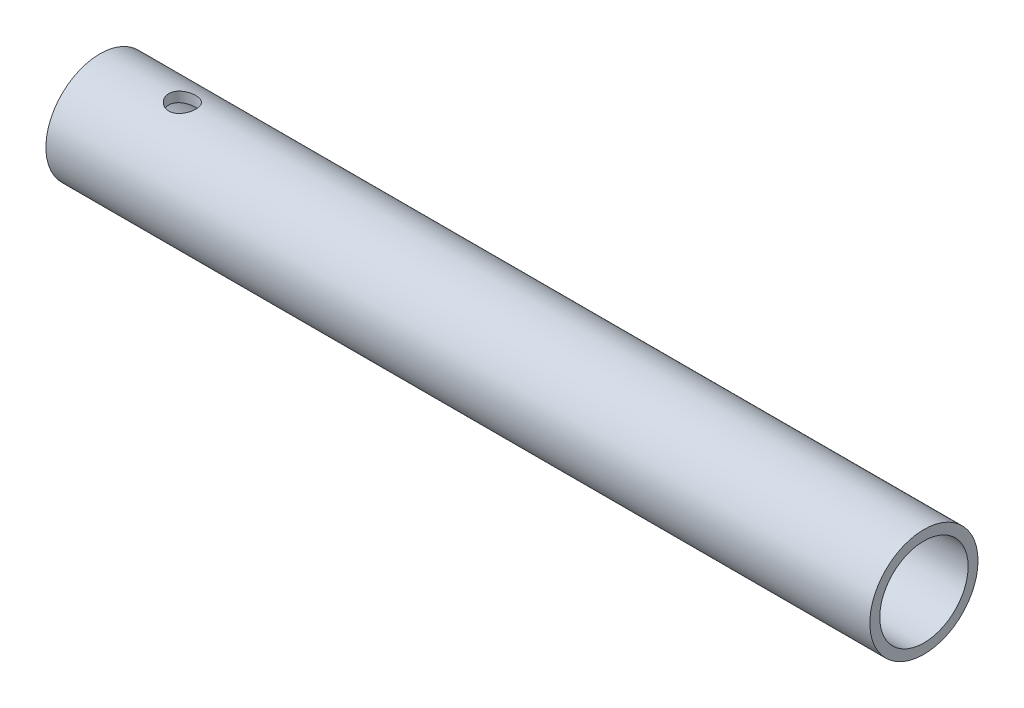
ISO-10303-21;
HEADER;
FILE_DESCRIPTION(('STEP AP214'),'2;1');
FILE_NAME('part.step','',(''),(''),'','','');
FILE_SCHEMA(('AUTOMOTIVE_DESIGN { 1 0 10303 214 1 1 1 1 }'));
ENDSEC;
DATA;
#1=APPLICATION_CONTEXT('core data for automotive mechanical design processes');
#2=APPLICATION_PROTOCOL_DEFINITION('international standard','automotive_design',2000,#1);
#3=PRODUCT_CONTEXT('',#1,'mechanical');
#4=PRODUCT('Part','Part','',(#3));
#5=PRODUCT_RELATED_PRODUCT_CATEGORY('part','',(#4));
#6=PRODUCT_DEFINITION_FORMATION('','',#4);
#7=PRODUCT_DEFINITION_CONTEXT('part definition',#1,'design');
#8=PRODUCT_DEFINITION('design','',#6,#7);
#9=PRODUCT_DEFINITION_SHAPE('','',#8);
#10=(LENGTH_UNIT() NAMED_UNIT(*) SI_UNIT(.MILLI.,.METRE.));
#11=(NAMED_UNIT(*) PLANE_ANGLE_UNIT() SI_UNIT($,.RADIAN.));
#12=(NAMED_UNIT(*) SI_UNIT($,.STERADIAN.) SOLID_ANGLE_UNIT());
#13=UNCERTAINTY_MEASURE_WITH_UNIT(LENGTH_MEASURE(1.E-05),#10,'distance_accuracy_value','');
#14=(GEOMETRIC_REPRESENTATION_CONTEXT(3) GLOBAL_UNCERTAINTY_ASSIGNED_CONTEXT((#13)) GLOBAL_UNIT_ASSIGNED_CONTEXT((#10,
#11,#12)) REPRESENTATION_CONTEXT('',''));
#15=CARTESIAN_POINT('',(0.,0.,0.));
#16=DIRECTION('',(0.,0.,1.));
#17=DIRECTION('',(1.,0.,0.));
#18=AXIS2_PLACEMENT_3D('',#15,#16,#17);
#19=CARTESIAN_POINT('',(127.,0.,0.));
#20=DIRECTION('',(1.,0.,0.));
#21=DIRECTION('',(0.,0.,-1.));
#22=AXIS2_PLACEMENT_3D('',#19,#20,#21);
#23=PLANE('',#22);
#24=CARTESIAN_POINT('',(127.,0.,0.));
#25=DIRECTION('',(1.,0.,0.));
#26=DIRECTION('',(0.,0.,-1.));
#27=AXIS2_PLACEMENT_3D('',#24,#25,#26);
#28=CIRCLE('',#27,16.66875);
#29=CARTESIAN_POINT('',(127.,0.,-16.66875));
#30=VERTEX_POINT('',#29);
#31=EDGE_CURVE('E10',#30,#30,#28,.T.);
#32=ORIENTED_EDGE('',*,*,#31,.T.);
#33=EDGE_LOOP('',(#32));
#34=FACE_BOUND('',#33,.T.);
#35=CARTESIAN_POINT('',(127.,0.,0.));
#36=DIRECTION('',(1.,0.,0.));
#37=DIRECTION('',(0.,0.,-1.));
#38=AXIS2_PLACEMENT_3D('',#35,#36,#37);
#39=CIRCLE('',#38,13.62075);
#40=CARTESIAN_POINT('',(127.,0.,-13.62075));
#41=VERTEX_POINT('',#40);
#42=EDGE_CURVE('E46',#41,#41,#39,.T.);
#43=ORIENTED_EDGE('',*,*,#42,.F.);
#44=EDGE_LOOP('',(#43));
#45=FACE_BOUND('',#44,.T.);
#46=ADVANCED_FACE('F28',(#34,#45),#23,.T.);
#47=CARTESIAN_POINT('',(-127.,0.,0.));
#48=DIRECTION('',(1.,0.,0.));
#49=DIRECTION('',(0.,0.,-1.));
#50=AXIS2_PLACEMENT_3D('',#47,#48,#49);
#51=PLANE('',#50);
#52=CARTESIAN_POINT('',(-127.,0.,0.));
#53=DIRECTION('',(1.,0.,0.));
#54=DIRECTION('',(0.,0.,-1.));
#55=AXIS2_PLACEMENT_3D('',#52,#53,#54);
#56=CIRCLE('',#55,16.66875);
#57=CARTESIAN_POINT('',(-127.,0.,-16.66875));
#58=VERTEX_POINT('',#57);
#59=EDGE_CURVE('E41',#58,#58,#56,.T.);
#60=ORIENTED_EDGE('',*,*,#59,.F.);
#61=EDGE_LOOP('',(#60));
#62=FACE_BOUND('',#61,.T.);
#63=CARTESIAN_POINT('',(-127.,0.,0.));
#64=DIRECTION('',(1.,0.,0.));
#65=DIRECTION('',(0.,0.,-1.));
#66=AXIS2_PLACEMENT_3D('',#63,#64,#65);
#67=CIRCLE('',#66,13.62075);
#68=CARTESIAN_POINT('',(-127.,0.,-13.62075));
#69=VERTEX_POINT('',#68);
#70=EDGE_CURVE('E49',#69,#69,#67,.T.);
#71=ORIENTED_EDGE('',*,*,#70,.T.);
#72=EDGE_LOOP('',(#71));
#73=FACE_BOUND('',#72,.T.);
#74=ADVANCED_FACE('F82',(#62,#73),#51,.F.);
#75=CARTESIAN_POINT('',(127.,0.,0.));
#76=DIRECTION('',(-1.,0.,0.));
#77=DIRECTION('',(0.,0.,1.));
#78=AXIS2_PLACEMENT_3D('',#75,#76,#77);
#79=CYLINDRICAL_SURFACE('',#78,16.66875);
#80=CARTESIAN_POINT('',(-105.7656,-16.66875,0.));
#81=CARTESIAN_POINT('',(-105.76559353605,-16.6687461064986,0.230155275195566));
#82=CARTESIAN_POINT('',(-105.746461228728,-16.6639356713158,0.460382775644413));
#83=CARTESIAN_POINT('',(-105.670552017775,-16.6452120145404,0.91423964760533));
#84=CARTESIAN_POINT('',(-105.613753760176,-16.6312936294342,1.13786520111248));
#85=CARTESIAN_POINT('',(-105.46444870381,-16.5958953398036,1.57189852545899));
#86=CARTESIAN_POINT('',(-105.371984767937,-16.5744245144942,1.78232181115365));
#87=CARTESIAN_POINT('',(-105.154123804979,-16.5262081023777,2.18467032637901));
#88=CARTESIAN_POINT('',(-105.028725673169,-16.4994623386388,2.37659493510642));
#89=CARTESIAN_POINT('',(-104.745829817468,-16.4429842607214,2.74044827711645));
#90=CARTESIAN_POINT('',(-104.587781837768,-16.4132058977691,2.91194206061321));
#91=CARTESIAN_POINT('',(-104.245250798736,-16.3543248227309,3.22628543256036));
#92=CARTESIAN_POINT('',(-104.060764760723,-16.3252221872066,3.36913178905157));
#93=CARTESIAN_POINT('',(-103.667217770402,-16.2705234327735,3.62417065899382));
#94=CARTESIAN_POINT('',(-103.457832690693,-16.2449857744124,3.73587669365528));
#95=CARTESIAN_POINT('',(-103.022514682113,-16.200979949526,3.92233553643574));
#96=CARTESIAN_POINT('',(-102.796584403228,-16.1825106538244,3.99709424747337));
#97=CARTESIAN_POINT('',(-102.339371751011,-16.1552059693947,4.10605266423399));
#98=CARTESIAN_POINT('',(-102.108287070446,-16.1461851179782,4.14103437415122));
#99=CARTESIAN_POINT('',(-101.643366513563,-16.1382435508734,4.17188158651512));
#100=CARTESIAN_POINT('',(-101.409531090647,-16.1393211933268,4.16775344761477));
#101=CARTESIAN_POINT('',(-100.951739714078,-16.1512881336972,4.1211220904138));
#102=CARTESIAN_POINT('',(-100.7276816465,-16.1619391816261,4.079550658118));
#103=CARTESIAN_POINT('',(-100.289825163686,-16.1914731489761,3.96069914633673));
#104=CARTESIAN_POINT('',(-100.076027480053,-16.2103566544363,3.88341652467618));
#105=CARTESIAN_POINT('',(-99.6622617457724,-16.2544465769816,3.69454212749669));
#106=CARTESIAN_POINT('',(-99.4624549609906,-16.2797148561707,3.58261211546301));
#107=CARTESIAN_POINT('',(-99.0841255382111,-16.333692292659,3.32785678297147));
#108=CARTESIAN_POINT('',(-98.9056066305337,-16.3624020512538,3.18502606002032));
#109=CARTESIAN_POINT('',(-98.569580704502,-16.4210307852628,2.86769687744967));
#110=CARTESIAN_POINT('',(-98.4128172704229,-16.4509609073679,2.69241209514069));
#111=CARTESIAN_POINT('',(-98.1307692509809,-16.5079203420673,2.31768301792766));
#112=CARTESIAN_POINT('',(-98.0054856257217,-16.5349495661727,2.11823798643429));
#113=CARTESIAN_POINT('',(-97.7896807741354,-16.5831961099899,1.69978942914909));
#114=CARTESIAN_POINT('',(-97.6992802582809,-16.6043931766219,1.48072116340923));
#115=CARTESIAN_POINT('',(-97.5567957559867,-16.6384397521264,1.0298495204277));
#116=CARTESIAN_POINT('',(-97.5047044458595,-16.6512908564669,0.798048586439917));
#117=CARTESIAN_POINT('',(-97.4414524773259,-16.6669614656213,0.334649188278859));
#118=CARTESIAN_POINT('',(-97.4292791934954,-16.6700290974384,0.103197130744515));
#119=CARTESIAN_POINT('',(-97.4434315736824,-16.6664937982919,-0.358437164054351));
#120=CARTESIAN_POINT('',(-97.4697537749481,-16.6598917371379,-0.588619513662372));
#121=CARTESIAN_POINT('',(-97.5593152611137,-16.6379178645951,-1.03766207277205));
#122=CARTESIAN_POINT('',(-97.6220021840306,-16.6226773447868,-1.25663945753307));
#123=CARTESIAN_POINT('',(-97.7818827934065,-16.585144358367,-1.68095888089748));
#124=CARTESIAN_POINT('',(-97.8790799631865,-16.5628511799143,-1.88629954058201));
#125=CARTESIAN_POINT('',(-98.1071849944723,-16.5130914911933,-2.2815459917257));
#126=CARTESIAN_POINT('',(-98.2386601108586,-16.4855402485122,-2.47111348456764));
#127=CARTESIAN_POINT('',(-98.5308637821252,-16.4284542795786,-2.82585456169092));
#128=CARTESIAN_POINT('',(-98.6915973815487,-16.3989192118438,-2.99102393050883));
#129=CARTESIAN_POINT('',(-99.0424567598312,-16.3403013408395,-3.29645254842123));
#130=CARTESIAN_POINT('',(-99.2332067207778,-16.3112473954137,-3.43600150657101));
#131=CARTESIAN_POINT('',(-99.6360145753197,-16.2576896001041,-3.68110810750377));
#132=CARTESIAN_POINT('',(-99.8480715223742,-16.2331855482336,-3.78666725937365));
#133=CARTESIAN_POINT('',(-100.286336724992,-16.1917718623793,-3.96001221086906));
#134=CARTESIAN_POINT('',(-100.51245200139,-16.1748173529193,-4.02802180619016));
#135=CARTESIAN_POINT('',(-100.973395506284,-16.1503791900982,-4.12492702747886));
#136=CARTESIAN_POINT('',(-101.208221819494,-16.1428934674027,-4.15383119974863));
#137=CARTESIAN_POINT('',(-101.672693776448,-16.1383980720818,-4.17125880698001));
#138=CARTESIAN_POINT('',(-101.902294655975,-16.1410938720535,-4.16091747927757));
#139=CARTESIAN_POINT('',(-102.356367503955,-16.1559768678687,-4.10274562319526));
#140=CARTESIAN_POINT('',(-102.580839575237,-16.1681638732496,-4.05491584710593));
#141=CARTESIAN_POINT('',(-103.017049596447,-16.2004920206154,-3.92374460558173));
#142=CARTESIAN_POINT('',(-103.228855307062,-16.2205854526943,-3.84061591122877));
#143=CARTESIAN_POINT('',(-103.635664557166,-16.2664691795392,-3.64137497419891));
#144=CARTESIAN_POINT('',(-103.830665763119,-16.2922602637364,-3.52525816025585));
#145=CARTESIAN_POINT('',(-104.203816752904,-16.3474733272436,-3.25977735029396));
#146=CARTESIAN_POINT('',(-104.381394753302,-16.3769724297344,-3.10962558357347));
#147=CARTESIAN_POINT('',(-104.70920318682,-16.4358171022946,-2.78187247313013));
#148=CARTESIAN_POINT('',(-104.85942711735,-16.4651626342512,-2.60426462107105));
#149=CARTESIAN_POINT('',(-105.130913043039,-16.5210272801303,-2.22276256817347));
#150=CARTESIAN_POINT('',(-105.251601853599,-16.5474856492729,-2.01845090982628));
#151=CARTESIAN_POINT('',(-105.456727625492,-16.5939540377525,-1.59179589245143));
#152=CARTESIAN_POINT('',(-105.541190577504,-16.6139686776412,-1.36946559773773));
#153=CARTESIAN_POINT('',(-105.658921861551,-16.6423337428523,-0.956275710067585));
#154=CARTESIAN_POINT('',(-105.698839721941,-16.6521718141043,-0.767385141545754));
#155=CARTESIAN_POINT('',(-105.752180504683,-16.665381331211,-0.385679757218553));
#156=CARTESIAN_POINT('',(-105.765605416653,-16.6687532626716,-0.192865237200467));
#157=CARTESIAN_POINT('',(-105.7656,-16.66875,0.));
#158=B_SPLINE_CURVE_WITH_KNOTS('',3,(#80,#81,#82,#83,#84,#85,#86,#87,#88,#89,#90,#91,#92,#93,
#94,#95,#96,#97,#98,#99,#100,#101,#102,#103,#104,#105,#106,#107,#108,#109,#110,#111,#112,#113,
#114,#115,#116,#117,#118,#119,#120,#121,#122,#123,#124,#125,#126,#127,#128,#129,#130,#131,#132,
#133,#134,#135,#136,#137,#138,#139,#140,#141,#142,#143,#144,#145,#146,#147,#148,#149,#150,#151,
#152,#153,#154,#155,#156,#157),.UNSPECIFIED.,.T.,.F.,(4,2,2,2,2,2,2,2,2,2,2,2,2,2,2,2,2,2,2,2,2,
2,2,2,2,2,2,2,2,2,2,2,2,2,2,2,2,2,4),(0.,0.689759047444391,1.37990947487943,2.06923305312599,
2.75857975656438,3.4606625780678,4.1628245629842,4.87540899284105,5.58787953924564,
6.28608687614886,6.98418069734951,7.66536813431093,8.34660407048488,9.03471212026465,
9.72294057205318,10.4307778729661,11.1386367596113,11.8489236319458,12.5590746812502,
13.2510655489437,13.9429941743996,14.6246781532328,15.3064309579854,16.0002739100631,
16.6942366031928,17.405219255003,18.1161703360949,18.8228370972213,19.5293493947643,
20.2155826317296,20.9018020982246,21.5839426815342,22.2661778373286,22.9661972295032,
23.6663828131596,24.3792368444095,25.0915785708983,25.6696254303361,26.2476288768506),.UNSPECIFIED.);
#159=CARTESIAN_POINT('',(-105.7656,-16.66875,0.));
#160=VERTEX_POINT('',#159);
#161=EDGE_CURVE('E72',#160,#160,#158,.T.);
#162=ORIENTED_EDGE('',*,*,#161,.T.);
#163=EDGE_LOOP('',(#162));
#164=FACE_BOUND('',#163,.T.);
#165=CARTESIAN_POINT('',(-101.6,16.1398575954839,4.1656));
#166=CARTESIAN_POINT('',(-101.830028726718,16.1398619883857,4.16559346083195));
#167=CARTESIAN_POINT('',(-102.060129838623,16.1448289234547,4.14648146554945));
#168=CARTESIAN_POINT('',(-102.513724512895,16.1641092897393,4.07066023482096));
#169=CARTESIAN_POINT('',(-102.737214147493,16.1784281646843,4.01392910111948));
#170=CARTESIAN_POINT('',(-103.170959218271,16.2146917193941,3.86482019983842));
#171=CARTESIAN_POINT('',(-103.381231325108,16.2366265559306,3.77248842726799));
#172=CARTESIAN_POINT('',(-103.783323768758,16.2856382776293,3.55493924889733));
#173=CARTESIAN_POINT('',(-103.97514332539,16.3127153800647,3.42972045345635));
#174=CARTESIAN_POINT('',(-104.339103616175,16.3696272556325,3.14701064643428));
#175=CARTESIAN_POINT('',(-104.51077877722,16.3995060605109,2.98892900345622));
#176=CARTESIAN_POINT('',(-104.825475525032,16.4582727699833,2.64625303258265));
#177=CARTESIAN_POINT('',(-104.968494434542,16.4871605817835,2.46165623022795));
#178=CARTESIAN_POINT('',(-105.223723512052,16.5411775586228,2.06800068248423));
#179=CARTESIAN_POINT('',(-105.335476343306,16.5662487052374,1.85863676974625));
#180=CARTESIAN_POINT('',(-105.522027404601,16.6093051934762,1.42336411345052));
#181=CARTESIAN_POINT('',(-105.596831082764,16.6272915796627,1.19745781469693));
#182=CARTESIAN_POINT('',(-105.705869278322,16.6538406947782,0.740366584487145));
#183=CARTESIAN_POINT('',(-105.740894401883,16.6625868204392,0.509381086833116));
#184=CARTESIAN_POINT('',(-105.771862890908,16.6703090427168,0.0446582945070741));
#185=CARTESIAN_POINT('',(-105.767812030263,16.669286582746,-0.189078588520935));
#186=CARTESIAN_POINT('',(-105.721312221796,16.6577233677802,-0.647186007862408));
#187=CARTESIAN_POINT('',(-105.679716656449,16.6473941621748,-0.871649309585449));
#188=CARTESIAN_POINT('',(-105.560679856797,16.6186243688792,-1.31030333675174));
#189=CARTESIAN_POINT('',(-105.483236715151,16.6001833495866,-1.52449351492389));
#190=CARTESIAN_POINT('',(-105.294012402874,16.5569383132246,-1.93876991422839));
#191=CARTESIAN_POINT('',(-105.181927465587,16.5320783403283,-2.13871130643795));
#192=CARTESIAN_POINT('',(-104.926831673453,16.4786921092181,-2.51724623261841));
#193=CARTESIAN_POINT('',(-104.78381544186,16.4501652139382,-2.6958360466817));
#194=CARTESIAN_POINT('',(-104.466341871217,16.3916435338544,-3.0316876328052));
#195=CARTESIAN_POINT('',(-104.291138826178,16.3616299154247,-3.1882419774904));
#196=CARTESIAN_POINT('',(-103.916651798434,16.3042235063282,-3.46990539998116));
#197=CARTESIAN_POINT('',(-103.717366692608,16.276830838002,-3.59501301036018));
#198=CARTESIAN_POINT('',(-103.298985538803,16.2277004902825,-3.81068413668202));
#199=CARTESIAN_POINT('',(-103.079798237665,16.2059908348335,-3.90107745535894));
#200=CARTESIAN_POINT('',(-102.628664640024,16.1710442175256,-4.04351236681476));
#201=CARTESIAN_POINT('',(-102.396721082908,16.1578054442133,-4.09556215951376));
#202=CARTESIAN_POINT('',(-101.933219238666,16.1416796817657,-4.15865901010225));
#203=CARTESIAN_POINT('',(-101.701812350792,16.1385287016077,-4.1707519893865));
#204=CARTESIAN_POINT('',(-101.240286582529,16.1422167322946,-4.15645525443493));
#205=CARTESIAN_POINT('',(-101.010167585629,16.1490548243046,-4.13006907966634));
#206=CARTESIAN_POINT('',(-100.561632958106,16.1716975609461,-4.04048008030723));
#207=CARTESIAN_POINT('',(-100.343087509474,16.1873538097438,-3.97788611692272));
#208=CARTESIAN_POINT('',(-99.9195914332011,16.2257279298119,-3.8183333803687));
#209=CARTESIAN_POINT('',(-99.7146424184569,16.2484466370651,-3.72137053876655));
#210=CARTESIAN_POINT('',(-99.3197250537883,16.2989417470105,-3.49364288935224));
#211=CARTESIAN_POINT('',(-99.130129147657,16.3268085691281,-3.36225269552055));
#212=CARTESIAN_POINT('',(-98.775292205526,16.3842381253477,-3.07019088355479));
#213=CARTESIAN_POINT('',(-98.6100551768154,16.413801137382,-2.90951445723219));
#214=CARTESIAN_POINT('',(-98.3043901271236,16.4721866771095,-2.55864134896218));
#215=CARTESIAN_POINT('',(-98.1646856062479,16.5009722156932,-2.36780708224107));
#216=CARTESIAN_POINT('',(-97.9193056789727,16.5537943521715,-1.96478029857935));
#217=CARTESIAN_POINT('',(-97.8136284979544,16.5778311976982,-1.75258889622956));
#218=CARTESIAN_POINT('',(-97.6402201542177,16.6182961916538,-1.31433723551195));
#219=CARTESIAN_POINT('',(-97.5722161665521,16.6347788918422,-1.08839020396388));
#220=CARTESIAN_POINT('',(-97.4752655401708,16.6585172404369,-0.627808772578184));
#221=CARTESIAN_POINT('',(-97.4463113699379,16.665774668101,-0.393176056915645));
#222=CARTESIAN_POINT('',(-97.428705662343,16.6701721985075,0.0713191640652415));
#223=CARTESIAN_POINT('',(-97.4389863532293,16.6675803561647,0.301139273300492));
#224=CARTESIAN_POINT('',(-97.4971130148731,16.6531649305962,0.755667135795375));
#225=CARTESIAN_POINT('',(-97.544957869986,16.6413416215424,0.980375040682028));
#226=CARTESIAN_POINT('',(-97.6762822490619,16.6098331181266,1.41718320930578));
#227=CARTESIAN_POINT('',(-97.7595688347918,16.5901905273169,1.62934475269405));
#228=CARTESIAN_POINT('',(-97.9592373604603,16.5451119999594,2.03680209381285));
#229=CARTESIAN_POINT('',(-98.0756234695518,16.5196753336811,2.23209576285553));
#230=CARTESIAN_POINT('',(-98.3414444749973,16.4649903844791,2.60533698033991));
#231=CARTESIAN_POINT('',(-98.4916039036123,16.435665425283,2.78275728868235));
#232=CARTESIAN_POINT('',(-98.819302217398,16.3768541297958,3.11024421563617));
#233=CARTESIAN_POINT('',(-98.9968480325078,16.3473677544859,3.26030388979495));
#234=CARTESIAN_POINT('',(-99.3782624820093,16.290946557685,3.53155546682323));
#235=CARTESIAN_POINT('',(-99.5825600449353,16.2640695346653,3.65215720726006));
#236=CARTESIAN_POINT('',(-100.00917271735,16.2166879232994,3.85712378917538));
#237=CARTESIAN_POINT('',(-100.231474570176,16.1961786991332,3.94151500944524));
#238=CARTESIAN_POINT('',(-100.644489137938,16.1670619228,4.05909368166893));
#239=CARTESIAN_POINT('',(-100.833224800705,16.1569370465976,4.09894651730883));
#240=CARTESIAN_POINT('',(-101.214623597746,16.1433333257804,4.15220128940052));
#241=CARTESIAN_POINT('',(-101.407286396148,16.1398539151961,4.16560547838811));
#242=CARTESIAN_POINT('',(-101.6,16.1398575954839,4.1656));
#243=B_SPLINE_CURVE_WITH_KNOTS('',3,(#165,#166,#167,#168,#169,#170,#171,#172,#173,#174,#175,
#176,#177,#178,#179,#180,#181,#182,#183,#184,#185,#186,#187,#188,#189,#190,#191,#192,#193,#194,
#195,#196,#197,#198,#199,#200,#201,#202,#203,#204,#205,#206,#207,#208,#209,#210,#211,#212,#213,
#214,#215,#216,#217,#218,#219,#220,#221,#222,#223,#224,#225,#226,#227,#228,#229,#230,#231,#232,
#233,#234,#235,#236,#237,#238,#239,#240,#241,#242),.UNSPECIFIED.,.T.,.F.,(4,2,2,2,2,2,2,2,2,2,2,
2,2,2,2,2,2,2,2,2,2,2,2,2,2,2,2,2,2,2,2,2,2,2,2,2,2,2,4),(0.,0.689378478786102,1.37915860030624,
2.06805051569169,2.75697154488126,3.45955168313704,4.16219743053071,4.87463949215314,
5.58697647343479,6.28489328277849,6.98270696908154,7.6650482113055,8.34742576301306,
9.03596537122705,9.72462476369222,10.4319085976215,11.139225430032,11.8499671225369,
12.5605567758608,13.2523919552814,13.9441635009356,14.6246272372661,15.3051715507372,
15.9990571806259,16.6930568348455,17.4044065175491,18.1157190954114,18.8218107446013,
19.527766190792,20.2146479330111,20.9015092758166,21.584678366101,22.2679335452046,
22.9675470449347,23.6673378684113,24.3801713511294,25.0924846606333,25.6700817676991,
26.2476296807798),.UNSPECIFIED.);
#244=CARTESIAN_POINT('',(-101.6,16.1398575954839,4.1656));
#245=VERTEX_POINT('',#244);
#246=EDGE_CURVE('E68',#245,#245,#243,.T.);
#247=ORIENTED_EDGE('',*,*,#246,.T.);
#248=EDGE_LOOP('',(#247));
#249=FACE_BOUND('',#248,.T.);
#250=ORIENTED_EDGE('',*,*,#31,.F.);
#251=EDGE_LOOP('',(#250));
#252=FACE_BOUND('',#251,.T.);
#253=ORIENTED_EDGE('',*,*,#59,.T.);
#254=EDGE_LOOP('',(#253));
#255=FACE_BOUND('',#254,.T.);
#256=ADVANCED_FACE('F30',(#164,#249,#252,#255),#79,.T.);
#257=CARTESIAN_POINT('',(127.,0.,0.));
#258=DIRECTION('',(-1.,0.,0.));
#259=DIRECTION('',(0.,0.,1.));
#260=AXIS2_PLACEMENT_3D('',#257,#258,#259);
#261=CYLINDRICAL_SURFACE('',#260,13.62075);
#262=CARTESIAN_POINT('',(-101.6,-12.9681381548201,4.1656));
#263=CARTESIAN_POINT('',(-101.371968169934,-12.968140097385,4.16559774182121));
#264=CARTESIAN_POINT('',(-101.143913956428,-12.9742185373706,4.14681211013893));
#265=CARTESIAN_POINT('',(-100.694487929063,-12.9977736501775,4.07236935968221));
#266=CARTESIAN_POINT('',(-100.473118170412,-13.0152537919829,4.0167010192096));
#267=CARTESIAN_POINT('',(-100.043633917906,-13.0594513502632,3.87057190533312));
#268=CARTESIAN_POINT('',(-99.835497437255,-13.0861529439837,3.78017069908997));
#269=CARTESIAN_POINT('',(-99.4372908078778,-13.1457631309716,3.56733917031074));
#270=CARTESIAN_POINT('',(-99.2472235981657,-13.1786727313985,3.44490364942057));
#271=CARTESIAN_POINT('',(-98.8842987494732,-13.2482049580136,3.16716656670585));
#272=CARTESIAN_POINT('',(-98.7121231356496,-13.2849090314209,3.01099397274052));
#273=CARTESIAN_POINT('',(-98.3959519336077,-13.3572000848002,2.67208125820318));
#274=CARTESIAN_POINT('',(-98.2519601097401,-13.3927869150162,2.48933759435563));
#275=CARTESIAN_POINT('',(-97.9932601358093,-13.4597619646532,2.09759560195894));
#276=CARTESIAN_POINT('',(-97.879250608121,-13.491043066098,1.88811599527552));
#277=CARTESIAN_POINT('',(-97.6883443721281,-13.5449336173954,1.45183715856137));
#278=CARTESIAN_POINT('',(-97.6114393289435,-13.5675450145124,1.22504183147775));
#279=CARTESIAN_POINT('',(-97.4991914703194,-13.6009720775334,0.767707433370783));
#280=CARTESIAN_POINT('',(-97.4626837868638,-13.612117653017,0.537478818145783));
#281=CARTESIAN_POINT('',(-97.4285801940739,-13.6225206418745,0.0739123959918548));
#282=CARTESIAN_POINT('',(-97.4309758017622,-13.6217806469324,-0.159424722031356));
#283=CARTESIAN_POINT('',(-97.4738360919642,-13.6087274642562,-0.614400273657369));
#284=CARTESIAN_POINT('',(-97.5130387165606,-13.596797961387,-0.836170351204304));
#285=CARTESIAN_POINT('',(-97.6263343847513,-13.5631750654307,-1.26981812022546));
#286=CARTESIAN_POINT('',(-97.7004296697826,-13.541481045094,-1.48169517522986));
#287=CARTESIAN_POINT('',(-97.8822416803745,-13.4902433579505,-1.89250177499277));
#288=CARTESIAN_POINT('',(-97.990348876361,-13.4606091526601,-2.09124675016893));
#289=CARTESIAN_POINT('',(-98.2368050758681,-13.3966247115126,-2.46817332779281));
#290=CARTESIAN_POINT('',(-98.3751614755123,-13.3622733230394,-2.64634988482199));
#291=CARTESIAN_POINT('',(-98.68470380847,-13.290900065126,-2.9846108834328));
#292=CARTESIAN_POINT('',(-98.8569814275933,-13.253826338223,-3.14368674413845));
#293=CARTESIAN_POINT('',(-99.226122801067,-13.1823808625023,-3.43098215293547));
#294=CARTESIAN_POINT('',(-99.4229891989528,-13.1480094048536,-3.55919837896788));
#295=CARTESIAN_POINT('',(-99.8384647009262,-13.0856058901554,-3.78224244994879));
#296=CARTESIAN_POINT('',(-100.057277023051,-13.0576428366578,-3.87671247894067));
#297=CARTESIAN_POINT('',(-100.508762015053,-13.0120364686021,-4.02715639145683));
#298=CARTESIAN_POINT('',(-100.741429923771,-12.9943896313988,-4.08314341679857));
#299=CARTESIAN_POINT('',(-101.204392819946,-12.9721909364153,-4.15311891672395));
#300=CARTESIAN_POINT('',(-101.434432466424,-12.9671597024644,-4.1686457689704));
#301=CARTESIAN_POINT('',(-101.893841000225,-12.969433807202,-4.1615666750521));
#302=CARTESIAN_POINT('',(-102.123209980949,-12.9767373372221,-4.1389663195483));
#303=CARTESIAN_POINT('',(-102.56825479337,-13.0023862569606,-4.05764663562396));
#304=CARTESIAN_POINT('',(-102.784133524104,-13.0204245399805,-3.99993091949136));
#305=CARTESIAN_POINT('',(-103.203124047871,-13.065188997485,-3.85118929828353));
#306=CARTESIAN_POINT('',(-103.406233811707,-13.0919165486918,-3.76015811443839));
#307=CARTESIAN_POINT('',(-103.800143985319,-13.1519677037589,-3.5444889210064));
#308=CARTESIAN_POINT('',(-103.990447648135,-13.1854534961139,-3.41898992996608));
#309=CARTESIAN_POINT('',(-104.347855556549,-13.2549055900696,-3.13896200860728));
#310=CARTESIAN_POINT('',(-104.514954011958,-13.2908725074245,-2.98442585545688));
#311=CARTESIAN_POINT('',(-104.828002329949,-13.3629509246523,-2.64345647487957));
#312=CARTESIAN_POINT('',(-104.972858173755,-13.3990121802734,-2.45600561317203));
#313=CARTESIAN_POINT('',(-105.229092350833,-13.4657926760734,-2.05859096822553));
#314=CARTESIAN_POINT('',(-105.340472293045,-13.4965121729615,-1.84862826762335));
#315=CARTESIAN_POINT('',(-105.525519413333,-13.5489654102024,-1.41349804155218));
#316=CARTESIAN_POINT('',(-105.599464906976,-13.5707652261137,-1.18845724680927));
#317=CARTESIAN_POINT('',(-105.708230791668,-13.6032142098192,-0.728353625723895));
#318=CARTESIAN_POINT('',(-105.74306285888,-13.6138667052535,-0.49329381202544));
#319=CARTESIAN_POINT('',(-105.771697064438,-13.6226099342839,-0.0299164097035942));
#320=CARTESIAN_POINT('',(-105.76708279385,-13.6211855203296,0.198295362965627));
#321=CARTESIAN_POINT('',(-105.720761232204,-13.6070863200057,0.650547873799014));
#322=CARTESIAN_POINT('',(-105.679056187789,-13.5944122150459,0.874588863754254));
#323=CARTESIAN_POINT('',(-105.560730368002,-13.5593830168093,1.30961166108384));
#324=CARTESIAN_POINT('',(-105.484518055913,-13.5371413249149,1.52071433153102));
#325=CARTESIAN_POINT('',(-105.299707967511,-13.4852736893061,1.92724290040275));
#326=CARTESIAN_POINT('',(-105.191104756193,-13.4556465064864,2.12266616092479));
#327=CARTESIAN_POINT('',(-104.940457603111,-13.3908983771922,2.49928044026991));
#328=CARTESIAN_POINT('',(-104.797430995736,-13.3556287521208,2.6797916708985));
#329=CARTESIAN_POINT('',(-104.483749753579,-13.2840256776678,3.01477891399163));
#330=CARTESIAN_POINT('',(-104.313087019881,-13.2476919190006,3.16924726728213));
#331=CARTESIAN_POINT('',(-103.942565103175,-13.1767289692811,3.45263509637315));
#332=CARTESIAN_POINT('',(-103.741958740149,-13.1421888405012,3.58060255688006));
#333=CARTESIAN_POINT('',(-103.321064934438,-13.0801943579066,3.80085675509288));
#334=CARTESIAN_POINT('',(-103.100786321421,-13.0527368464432,3.89315940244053));
#335=CARTESIAN_POINT('',(-102.668902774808,-13.0105179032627,4.03187229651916));
#336=CARTESIAN_POINT('',(-102.458544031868,-12.9947800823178,4.08187785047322));
#337=CARTESIAN_POINT('',(-102.032129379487,-12.9735904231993,4.14873911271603));
#338=CARTESIAN_POINT('',(-101.816074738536,-12.9681363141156,4.16560213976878));
#339=CARTESIAN_POINT('',(-101.6,-12.9681381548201,4.1656));
#340=B_SPLINE_CURVE_WITH_KNOTS('',3,(#262,#263,#264,#265,#266,#267,#268,#269,#270,#271,#272,
#273,#274,#275,#276,#277,#278,#279,#280,#281,#282,#283,#284,#285,#286,#287,#288,#289,#290,#291,
#292,#293,#294,#295,#296,#297,#298,#299,#300,#301,#302,#303,#304,#305,#306,#307,#308,#309,#310,
#311,#312,#313,#314,#315,#316,#317,#318,#319,#320,#321,#322,#323,#324,#325,#326,#327,#328,#329,
#330,#331,#332,#333,#334,#335,#336,#337,#338,#339),.UNSPECIFIED.,.T.,.F.,(4,2,2,2,2,2,2,2,2,2,2,
2,2,2,2,2,2,2,2,2,2,2,2,2,2,2,2,2,2,2,2,2,2,2,2,2,2,2,4),(0.,0.683297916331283,1.36680382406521,
2.04914270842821,2.73159238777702,3.43438845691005,4.13727833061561,4.85532912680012,
5.57321855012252,6.26981950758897,6.96626857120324,7.63967706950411,8.31312883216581,
8.99461301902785,9.67626401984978,10.3851771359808,11.0941665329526,11.8104646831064,
12.5265180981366,13.2149194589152,13.9032198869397,14.5727164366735,15.2423191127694,
15.930467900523,16.6187880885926,17.3342555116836,18.0496885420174,18.7597213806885,
19.4695422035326,20.1510049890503,20.8324265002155,21.5059847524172,22.1796560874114,
22.875491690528,23.5715315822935,24.2893773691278,25.0069025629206,25.654514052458,
26.3019825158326),.UNSPECIFIED.);
#341=CARTESIAN_POINT('',(-101.6,-12.9681381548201,4.1656));
#342=VERTEX_POINT('',#341);
#343=EDGE_CURVE('E33',#342,#342,#340,.T.);
#344=ORIENTED_EDGE('',*,*,#343,.F.);
#345=EDGE_LOOP('',(#344));
#346=FACE_BOUND('',#345,.T.);
#347=CARTESIAN_POINT('',(-101.6,12.9681381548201,4.1656));
#348=CARTESIAN_POINT('',(-101.828031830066,12.968140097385,4.16559774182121));
#349=CARTESIAN_POINT('',(-102.056086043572,12.9742185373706,4.14681211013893));
#350=CARTESIAN_POINT('',(-102.505512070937,12.9977736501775,4.07236935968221));
#351=CARTESIAN_POINT('',(-102.726881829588,13.0152537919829,4.0167010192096));
#352=CARTESIAN_POINT('',(-103.156366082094,13.0594513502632,3.87057190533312));
#353=CARTESIAN_POINT('',(-103.364502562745,13.0861529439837,3.78017069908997));
#354=CARTESIAN_POINT('',(-103.762709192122,13.1457631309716,3.56733917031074));
#355=CARTESIAN_POINT('',(-103.952776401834,13.1786727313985,3.44490364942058));
#356=CARTESIAN_POINT('',(-104.315701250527,13.2482049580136,3.16716656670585));
#357=CARTESIAN_POINT('',(-104.48787686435,13.2849090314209,3.01099397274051));
#358=CARTESIAN_POINT('',(-104.804048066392,13.3572000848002,2.67208125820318));
#359=CARTESIAN_POINT('',(-104.94803989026,13.3927869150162,2.48933759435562));
#360=CARTESIAN_POINT('',(-105.206739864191,13.4597619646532,2.09759560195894));
#361=CARTESIAN_POINT('',(-105.320749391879,13.491043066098,1.88811599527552));
#362=CARTESIAN_POINT('',(-105.511655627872,13.5449336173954,1.45183715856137));
#363=CARTESIAN_POINT('',(-105.588560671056,13.5675450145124,1.22504183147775));
#364=CARTESIAN_POINT('',(-105.700808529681,13.6009720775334,0.767707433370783));
#365=CARTESIAN_POINT('',(-105.737316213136,13.612117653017,0.537478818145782));
#366=CARTESIAN_POINT('',(-105.771419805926,13.6225206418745,0.0739123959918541));
#367=CARTESIAN_POINT('',(-105.769024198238,13.6217806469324,-0.159424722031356));
#368=CARTESIAN_POINT('',(-105.726163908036,13.6087274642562,-0.614400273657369));
#369=CARTESIAN_POINT('',(-105.686961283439,13.596797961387,-0.836170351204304));
#370=CARTESIAN_POINT('',(-105.573665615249,13.5631750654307,-1.26981812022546));
#371=CARTESIAN_POINT('',(-105.499570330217,13.541481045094,-1.48169517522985));
#372=CARTESIAN_POINT('',(-105.317758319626,13.4902433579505,-1.89250177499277));
#373=CARTESIAN_POINT('',(-105.209651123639,13.4606091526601,-2.09124675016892));
#374=CARTESIAN_POINT('',(-104.963194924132,13.3966247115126,-2.4681733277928));
#375=CARTESIAN_POINT('',(-104.824838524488,13.3622733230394,-2.64634988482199));
#376=CARTESIAN_POINT('',(-104.51529619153,13.290900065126,-2.9846108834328));
#377=CARTESIAN_POINT('',(-104.343018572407,13.253826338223,-3.14368674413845));
#378=CARTESIAN_POINT('',(-103.973877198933,13.1823808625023,-3.43098215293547));
#379=CARTESIAN_POINT('',(-103.777010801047,13.1480094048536,-3.55919837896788));
#380=CARTESIAN_POINT('',(-103.361535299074,13.0856058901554,-3.78224244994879));
#381=CARTESIAN_POINT('',(-103.142722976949,13.0576428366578,-3.87671247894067));
#382=CARTESIAN_POINT('',(-102.691237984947,13.0120364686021,-4.02715639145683));
#383=CARTESIAN_POINT('',(-102.458570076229,12.9943896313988,-4.08314341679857));
#384=CARTESIAN_POINT('',(-101.995607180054,12.9721909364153,-4.15311891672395));
#385=CARTESIAN_POINT('',(-101.765567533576,12.9671597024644,-4.1686457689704));
#386=CARTESIAN_POINT('',(-101.306158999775,12.969433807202,-4.1615666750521));
#387=CARTESIAN_POINT('',(-101.076790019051,12.9767373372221,-4.1389663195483));
#388=CARTESIAN_POINT('',(-100.63174520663,13.0023862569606,-4.05764663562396));
#389=CARTESIAN_POINT('',(-100.415866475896,13.0204245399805,-3.99993091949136));
#390=CARTESIAN_POINT('',(-99.9968759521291,13.065188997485,-3.85118929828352));
#391=CARTESIAN_POINT('',(-99.7937661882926,13.0919165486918,-3.76015811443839));
#392=CARTESIAN_POINT('',(-99.3998560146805,13.1519677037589,-3.5444889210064));
#393=CARTESIAN_POINT('',(-99.2095523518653,13.1854534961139,-3.41898992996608));
#394=CARTESIAN_POINT('',(-98.8521444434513,13.2549055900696,-3.13896200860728));
#395=CARTESIAN_POINT('',(-98.6850459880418,13.2908725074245,-2.98442585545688));
#396=CARTESIAN_POINT('',(-98.3719976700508,13.3629509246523,-2.64345647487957));
#397=CARTESIAN_POINT('',(-98.2271418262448,13.3990121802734,-2.45600561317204));
#398=CARTESIAN_POINT('',(-97.970907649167,13.4657926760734,-2.05859096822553));
#399=CARTESIAN_POINT('',(-97.8595277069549,13.4965121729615,-1.84862826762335));
#400=CARTESIAN_POINT('',(-97.6744805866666,13.5489654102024,-1.41349804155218));
#401=CARTESIAN_POINT('',(-97.6005350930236,13.5707652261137,-1.18845724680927));
#402=CARTESIAN_POINT('',(-97.4917692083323,13.6032142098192,-0.728353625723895));
#403=CARTESIAN_POINT('',(-97.4569371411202,13.6138667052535,-0.49329381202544));
#404=CARTESIAN_POINT('',(-97.4283029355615,13.6226099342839,-0.0299164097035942));
#405=CARTESIAN_POINT('',(-97.4329172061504,13.6211855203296,0.198295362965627));
#406=CARTESIAN_POINT('',(-97.4792387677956,13.6070863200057,0.650547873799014));
#407=CARTESIAN_POINT('',(-97.5209438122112,13.5944122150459,0.874588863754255));
#408=CARTESIAN_POINT('',(-97.6392696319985,13.5593830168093,1.30961166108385));
#409=CARTESIAN_POINT('',(-97.7154819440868,13.5371413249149,1.52071433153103));
#410=CARTESIAN_POINT('',(-97.9002920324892,13.4852736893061,1.92724290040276));
#411=CARTESIAN_POINT('',(-98.0088952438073,13.4556465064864,2.1226661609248));
#412=CARTESIAN_POINT('',(-98.2595423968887,13.3908983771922,2.49928044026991));
#413=CARTESIAN_POINT('',(-98.4025690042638,13.3556287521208,2.6797916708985));
#414=CARTESIAN_POINT('',(-98.7162502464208,13.2840256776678,3.01477891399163));
#415=CARTESIAN_POINT('',(-98.8869129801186,13.2476919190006,3.16924726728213));
#416=CARTESIAN_POINT('',(-99.2574348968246,13.1767289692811,3.45263509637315));
#417=CARTESIAN_POINT('',(-99.4580412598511,13.1421888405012,3.58060255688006));
#418=CARTESIAN_POINT('',(-99.8789350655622,13.0801943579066,3.80085675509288));
#419=CARTESIAN_POINT('',(-100.099213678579,13.0527368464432,3.89315940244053));
#420=CARTESIAN_POINT('',(-100.531097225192,13.0105179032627,4.03187229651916));
#421=CARTESIAN_POINT('',(-100.741455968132,12.9947800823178,4.08187785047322));
#422=CARTESIAN_POINT('',(-101.167870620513,12.9735904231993,4.14873911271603));
#423=CARTESIAN_POINT('',(-101.383925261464,12.9681363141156,4.16560213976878));
#424=CARTESIAN_POINT('',(-101.6,12.9681381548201,4.1656));
#425=B_SPLINE_CURVE_WITH_KNOTS('',3,(#347,#348,#349,#350,#351,#352,#353,#354,#355,#356,#357,
#358,#359,#360,#361,#362,#363,#364,#365,#366,#367,#368,#369,#370,#371,#372,#373,#374,#375,#376,
#377,#378,#379,#380,#381,#382,#383,#384,#385,#386,#387,#388,#389,#390,#391,#392,#393,#394,#395,
#396,#397,#398,#399,#400,#401,#402,#403,#404,#405,#406,#407,#408,#409,#410,#411,#412,#413,#414,
#415,#416,#417,#418,#419,#420,#421,#422,#423,#424),.UNSPECIFIED.,.T.,.F.,(4,2,2,2,2,2,2,2,2,2,2,
2,2,2,2,2,2,2,2,2,2,2,2,2,2,2,2,2,2,2,2,2,2,2,2,2,2,2,4),(0.,0.683297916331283,1.36680382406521,
2.04914270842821,2.73159238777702,3.43438845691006,4.13727833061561,4.85532912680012,
5.57321855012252,6.26981950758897,6.96626857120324,7.63967706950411,8.31312883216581,
8.99461301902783,9.67626401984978,10.3851771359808,11.0941665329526,11.8104646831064,
12.5265180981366,13.2149194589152,13.9032198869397,14.5727164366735,15.2423191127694,
15.9304679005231,16.6187880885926,17.3342555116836,18.0496885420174,18.7597213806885,
19.4695422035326,20.1510049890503,20.8324265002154,21.5059847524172,22.1796560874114,
22.8754916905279,23.5715315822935,24.2893773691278,25.0069025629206,25.654514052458,
26.3019825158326),.UNSPECIFIED.);
#426=CARTESIAN_POINT('',(-101.6,12.9681381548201,4.1656));
#427=VERTEX_POINT('',#426);
#428=EDGE_CURVE('E51',#427,#427,#425,.T.);
#429=ORIENTED_EDGE('',*,*,#428,.F.);
#430=EDGE_LOOP('',(#429));
#431=FACE_BOUND('',#430,.T.);
#432=ORIENTED_EDGE('',*,*,#42,.T.);
#433=EDGE_LOOP('',(#432));
#434=FACE_BOUND('',#433,.T.);
#435=ORIENTED_EDGE('',*,*,#70,.F.);
#436=EDGE_LOOP('',(#435));
#437=FACE_BOUND('',#436,.T.);
#438=ADVANCED_FACE('F55',(#346,#431,#434,#437),#261,.F.);
#439=CARTESIAN_POINT('',(-101.6,-16.66875,0.));
#440=DIRECTION('',(0.,1.,0.));
#441=DIRECTION('',(0.,0.,1.));
#442=AXIS2_PLACEMENT_3D('',#439,#440,#441);
#443=CYLINDRICAL_SURFACE('',#442,4.1656);
#444=ORIENTED_EDGE('',*,*,#428,.T.);
#445=EDGE_LOOP('',(#444));
#446=FACE_BOUND('',#445,.T.);
#447=ORIENTED_EDGE('',*,*,#246,.F.);
#448=EDGE_LOOP('',(#447));
#449=FACE_BOUND('',#448,.T.);
#450=ADVANCED_FACE('F61',(#446,#449),#443,.F.);
#451=ORIENTED_EDGE('',*,*,#343,.T.);
#452=EDGE_LOOP('',(#451));
#453=FACE_BOUND('',#452,.T.);
#454=ORIENTED_EDGE('',*,*,#161,.F.);
#455=EDGE_LOOP('',(#454));
#456=FACE_BOUND('',#455,.T.);
#457=ADVANCED_FACE('F58',(#453,#456),#443,.F.);
#458=CLOSED_SHELL('',(#46,#74,#256,#438,#450,#457));
#459=MANIFOLD_SOLID_BREP('B2',#458);
#460=ADVANCED_BREP_SHAPE_REPRESENTATION('',(#18,#459),#14);
#461=SHAPE_DEFINITION_REPRESENTATION(#9,#460);
ENDSEC;
END-ISO-10303-21;
